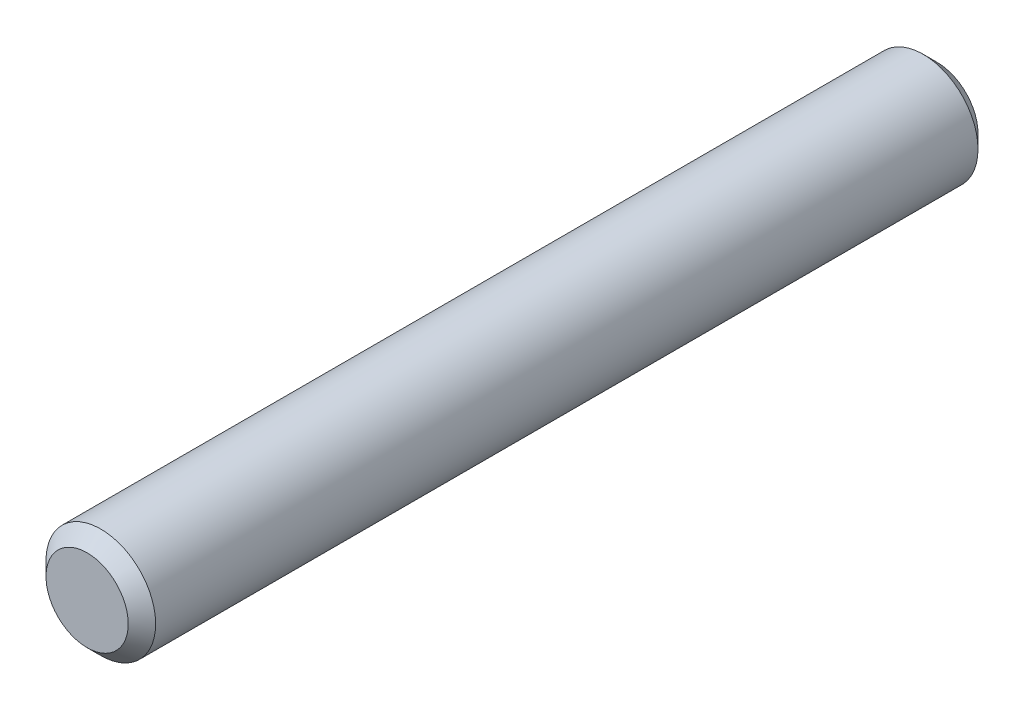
ISO-10303-21;
HEADER;
FILE_DESCRIPTION(('STEP AP214'),'2;1');
FILE_NAME('part.step','',(''),(''),'','','');
FILE_SCHEMA(('AUTOMOTIVE_DESIGN { 1 0 10303 214 1 1 1 1 }'));
ENDSEC;
DATA;
#1=APPLICATION_CONTEXT('core data for automotive mechanical design processes');
#2=APPLICATION_PROTOCOL_DEFINITION('international standard','automotive_design',2000,#1);
#3=PRODUCT_CONTEXT('',#1,'mechanical');
#4=PRODUCT('Part','Part','',(#3));
#5=PRODUCT_RELATED_PRODUCT_CATEGORY('part','',(#4));
#6=PRODUCT_DEFINITION_FORMATION('','',#4);
#7=PRODUCT_DEFINITION_CONTEXT('part definition',#1,'design');
#8=PRODUCT_DEFINITION('design','',#6,#7);
#9=PRODUCT_DEFINITION_SHAPE('','',#8);
#10=(LENGTH_UNIT() NAMED_UNIT(*) SI_UNIT(.MILLI.,.METRE.));
#11=(NAMED_UNIT(*) PLANE_ANGLE_UNIT() SI_UNIT($,.RADIAN.));
#12=(NAMED_UNIT(*) SI_UNIT($,.STERADIAN.) SOLID_ANGLE_UNIT());
#13=UNCERTAINTY_MEASURE_WITH_UNIT(LENGTH_MEASURE(1.E-05),#10,'distance_accuracy_value','');
#14=(GEOMETRIC_REPRESENTATION_CONTEXT(3) GLOBAL_UNCERTAINTY_ASSIGNED_CONTEXT((#13)) GLOBAL_UNIT_ASSIGNED_CONTEXT((#10,
#11,#12)) REPRESENTATION_CONTEXT('',''));
#15=CARTESIAN_POINT('',(0.,0.,0.));
#16=DIRECTION('',(0.,0.,1.));
#17=DIRECTION('',(1.,0.,0.));
#18=AXIS2_PLACEMENT_3D('',#15,#16,#17);
#19=CARTESIAN_POINT('',(0.,0.,31.));
#20=DIRECTION('',(0.,0.,-1.));
#21=DIRECTION('',(-1.,0.,0.));
#22=AXIS2_PLACEMENT_3D('',#19,#20,#21);
#23=CYLINDRICAL_SURFACE('',#22,2.);
#24=CARTESIAN_POINT('',(0.,0.,30.5));
#25=DIRECTION('',(0.,0.,1.));
#26=DIRECTION('',(1.,0.,0.));
#27=AXIS2_PLACEMENT_3D('',#24,#25,#26);
#28=CIRCLE('',#27,2.);
#29=CARTESIAN_POINT('',(2.,0.,30.5));
#30=VERTEX_POINT('',#29);
#31=EDGE_CURVE('E10',#30,#30,#28,.F.);
#32=ORIENTED_EDGE('',*,*,#31,.T.);
#33=EDGE_LOOP('',(#32));
#34=FACE_BOUND('',#33,.T.);
#35=CARTESIAN_POINT('',(0.,0.,0.500000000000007));
#36=DIRECTION('',(0.,0.,1.));
#37=DIRECTION('',(1.,0.,0.));
#38=AXIS2_PLACEMENT_3D('',#35,#36,#37);
#39=CIRCLE('',#38,2.);
#40=CARTESIAN_POINT('',(2.,0.,0.500000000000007));
#41=VERTEX_POINT('',#40);
#42=EDGE_CURVE('E38',#41,#41,#39,.T.);
#43=ORIENTED_EDGE('',*,*,#42,.T.);
#44=EDGE_LOOP('',(#43));
#45=FACE_BOUND('',#44,.T.);
#46=ADVANCED_FACE('F24',(#34,#45),#23,.T.);
#47=CARTESIAN_POINT('',(0.,0.,31.));
#48=DIRECTION('',(0.,0.,1.));
#49=DIRECTION('',(1.,0.,0.));
#50=AXIS2_PLACEMENT_3D('',#47,#48,#49);
#51=PLANE('',#50);
#52=CARTESIAN_POINT('',(0.,0.,31.));
#53=DIRECTION('',(0.,0.,1.));
#54=DIRECTION('',(1.,0.,0.));
#55=AXIS2_PLACEMENT_3D('',#52,#53,#54);
#56=CIRCLE('',#55,1.49999999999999);
#57=CARTESIAN_POINT('',(1.49999999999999,0.,31.));
#58=VERTEX_POINT('',#57);
#59=EDGE_CURVE('E30',#58,#58,#56,.T.);
#60=ORIENTED_EDGE('',*,*,#59,.T.);
#61=EDGE_LOOP('',(#60));
#62=FACE_BOUND('',#61,.T.);
#63=ADVANCED_FACE('F57',(#62),#51,.T.);
#64=CARTESIAN_POINT('',(0.,0.,0.));
#65=DIRECTION('',(0.,0.,1.));
#66=DIRECTION('',(1.,0.,0.));
#67=AXIS2_PLACEMENT_3D('',#64,#65,#66);
#68=PLANE('',#67);
#69=CARTESIAN_POINT('',(0.,0.,0.));
#70=DIRECTION('',(0.,0.,1.));
#71=DIRECTION('',(1.,0.,0.));
#72=AXIS2_PLACEMENT_3D('',#69,#70,#71);
#73=CIRCLE('',#72,1.5);
#74=CARTESIAN_POINT('',(1.5,0.,0.));
#75=VERTEX_POINT('',#74);
#76=EDGE_CURVE('E34',#75,#75,#73,.F.);
#77=ORIENTED_EDGE('',*,*,#76,.T.);
#78=EDGE_LOOP('',(#77));
#79=FACE_BOUND('',#78,.T.);
#80=ADVANCED_FACE('F48',(#79),#68,.F.);
#81=CARTESIAN_POINT('',(0.,0.,0.500000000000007));
#82=DIRECTION('',(0.,0.,1.));
#83=DIRECTION('',(1.,0.,0.));
#84=AXIS2_PLACEMENT_3D('',#81,#82,#83);
#85=CONICAL_SURFACE('',#84,2.,0.785398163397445);
#86=ORIENTED_EDGE('',*,*,#76,.F.);
#87=EDGE_LOOP('',(#86));
#88=FACE_BOUND('',#87,.T.);
#89=ORIENTED_EDGE('',*,*,#42,.F.);
#90=EDGE_LOOP('',(#89));
#91=FACE_BOUND('',#90,.T.);
#92=ADVANCED_FACE('F45',(#88,#91),#85,.T.);
#93=CARTESIAN_POINT('',(0.,0.,31.));
#94=DIRECTION('',(0.,0.,-1.));
#95=DIRECTION('',(-1.,0.,0.));
#96=AXIS2_PLACEMENT_3D('',#93,#94,#95);
#97=CONICAL_SURFACE('',#96,1.49999999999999,0.785398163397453);
#98=ORIENTED_EDGE('',*,*,#31,.F.);
#99=EDGE_LOOP('',(#98));
#100=FACE_BOUND('',#99,.T.);
#101=ORIENTED_EDGE('',*,*,#59,.F.);
#102=EDGE_LOOP('',(#101));
#103=FACE_BOUND('',#102,.T.);
#104=ADVANCED_FACE('F47',(#100,#103),#97,.T.);
#105=CLOSED_SHELL('',(#46,#63,#80,#92,#104));
#106=MANIFOLD_SOLID_BREP('B2',#105);
#107=ADVANCED_BREP_SHAPE_REPRESENTATION('',(#18,#106),#14);
#108=SHAPE_DEFINITION_REPRESENTATION(#9,#107);
ENDSEC;
END-ISO-10303-21;
